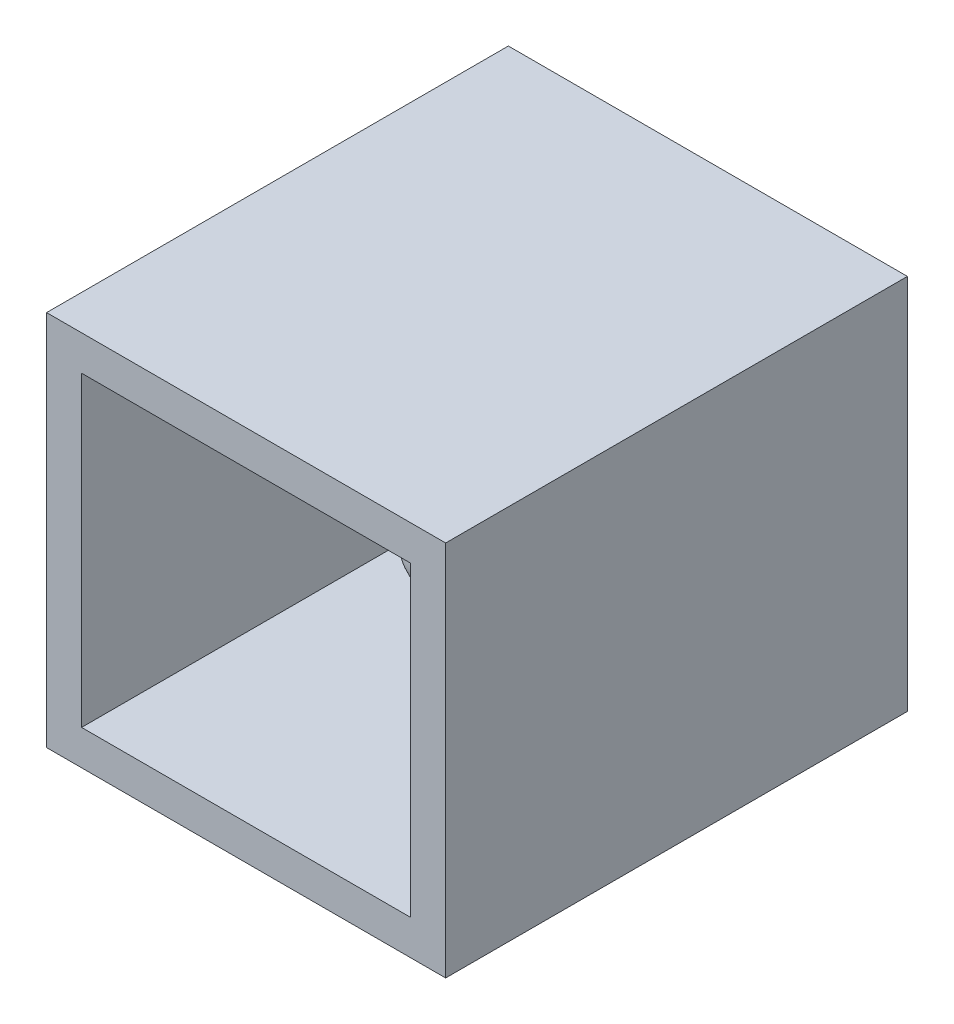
ISO-10303-21;
HEADER;
FILE_DESCRIPTION(('STEP AP214'),'2;1');
FILE_NAME('part.step','',(''),(''),'','','');
FILE_SCHEMA(('AUTOMOTIVE_DESIGN { 1 0 10303 214 1 1 1 1 }'));
ENDSEC;
DATA;
#1=APPLICATION_CONTEXT('core data for automotive mechanical design processes');
#2=APPLICATION_PROTOCOL_DEFINITION('international standard','automotive_design',2000,#1);
#3=PRODUCT_CONTEXT('',#1,'mechanical');
#4=PRODUCT('Part','Part','',(#3));
#5=PRODUCT_RELATED_PRODUCT_CATEGORY('part','',(#4));
#6=PRODUCT_DEFINITION_FORMATION('','',#4);
#7=PRODUCT_DEFINITION_CONTEXT('part definition',#1,'design');
#8=PRODUCT_DEFINITION('design','',#6,#7);
#9=PRODUCT_DEFINITION_SHAPE('','',#8);
#10=(LENGTH_UNIT() NAMED_UNIT(*) SI_UNIT(.MILLI.,.METRE.));
#11=(NAMED_UNIT(*) PLANE_ANGLE_UNIT() SI_UNIT($,.RADIAN.));
#12=(NAMED_UNIT(*) SI_UNIT($,.STERADIAN.) SOLID_ANGLE_UNIT());
#13=UNCERTAINTY_MEASURE_WITH_UNIT(LENGTH_MEASURE(1.E-05),#10,'distance_accuracy_value','');
#14=(GEOMETRIC_REPRESENTATION_CONTEXT(3) GLOBAL_UNCERTAINTY_ASSIGNED_CONTEXT((#13)) GLOBAL_UNIT_ASSIGNED_CONTEXT((#10,
#11,#12)) REPRESENTATION_CONTEXT('',''));
#15=CARTESIAN_POINT('',(0.,0.,0.));
#16=DIRECTION('',(0.,0.,1.));
#17=DIRECTION('',(1.,0.,0.));
#18=AXIS2_PLACEMENT_3D('',#15,#16,#17);
#19=CARTESIAN_POINT('',(0.,38.5181145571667,59.6854477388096));
#20=DIRECTION('',(0.,1.,0.));
#21=DIRECTION('',(0.,0.,-1.));
#22=AXIS2_PLACEMENT_3D('',#19,#20,#21);
#23=SPHERICAL_SURFACE('',#22,12.9621362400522);
#24=CARTESIAN_POINT('',(0.,51.4802507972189,59.6854477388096));
#25=VERTEX_POINT('',#24);
#26=VERTEX_LOOP('',#25);
#27=FACE_BOUND('',#26,.T.);
#28=ADVANCED_FACE('F64',(#27),#23,.T.);
#29=CLOSED_SHELL('',(#28));
#30=MANIFOLD_SOLID_BREP('B2',#29);
#31=CARTESIAN_POINT('',(-56.627294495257,-9.99999999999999,122.));
#32=DIRECTION('',(0.,0.,1.));
#33=DIRECTION('',(1.,0.,0.));
#34=AXIS2_PLACEMENT_3D('',#31,#32,#33);
#35=PLANE('',#34);
#36=DIRECTION('',(0.,-1.,0.));
#37=VECTOR('',#36,1.);
#38=CARTESIAN_POINT('',(-56.627294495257,87.6986315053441,122.));
#39=LINE('',#38,#37);
#40=CARTESIAN_POINT('',(-56.627294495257,97.6986315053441,122.));
#41=VERTEX_POINT('',#40);
#42=CARTESIAN_POINT('',(-56.627294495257,-10.,122.));
#43=VERTEX_POINT('',#42);
#44=EDGE_CURVE('E195',#41,#43,#39,.T.);
#45=ORIENTED_EDGE('',*,*,#44,.T.);
#46=DIRECTION('',(1.,0.,0.));
#47=VECTOR('',#46,1.);
#48=CARTESIAN_POINT('',(-46.627294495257,-9.99999999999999,122.));
#49=LINE('',#48,#47);
#50=CARTESIAN_POINT('',(57.4509829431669,-10.,122.));
#51=VERTEX_POINT('',#50);
#52=EDGE_CURVE('E148',#43,#51,#49,.T.);
#53=ORIENTED_EDGE('',*,*,#52,.T.);
#54=DIRECTION('',(0.,1.,0.));
#55=VECTOR('',#54,1.);
#56=CARTESIAN_POINT('',(57.4509829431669,87.6986315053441,122.));
#57=LINE('',#56,#55);
#58=CARTESIAN_POINT('',(57.4509829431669,97.6986315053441,122.));
#59=VERTEX_POINT('',#58);
#60=EDGE_CURVE('E198',#51,#59,#57,.T.);
#61=ORIENTED_EDGE('',*,*,#60,.T.);
#62=DIRECTION('',(-1.,0.,0.));
#63=VECTOR('',#62,1.);
#64=CARTESIAN_POINT('',(-46.627294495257,97.6986315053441,122.));
#65=LINE('',#64,#63);
#66=EDGE_CURVE('E101',#59,#41,#65,.T.);
#67=ORIENTED_EDGE('',*,*,#66,.T.);
#68=EDGE_LOOP('',(#45,#53,#61,#67));
#69=FACE_BOUND('',#68,.T.);
#70=DIRECTION('',(1.,0.,0.));
#71=VECTOR('',#70,1.);
#72=CARTESIAN_POINT('',(-46.627294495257,0.,122.));
#73=LINE('',#72,#71);
#74=CARTESIAN_POINT('',(-46.627294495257,0.,122.));
#75=VERTEX_POINT('',#74);
#76=CARTESIAN_POINT('',(47.4509829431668,0.,122.));
#77=VERTEX_POINT('',#76);
#78=EDGE_CURVE('E170',#75,#77,#73,.T.);
#79=ORIENTED_EDGE('',*,*,#78,.F.);
#80=DIRECTION('',(0.,-1.,0.));
#81=VECTOR('',#80,1.);
#82=CARTESIAN_POINT('',(-46.627294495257,0.,122.));
#83=LINE('',#82,#81);
#84=CARTESIAN_POINT('',(-46.627294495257,87.6986315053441,122.));
#85=VERTEX_POINT('',#84);
#86=EDGE_CURVE('E168',#85,#75,#83,.T.);
#87=ORIENTED_EDGE('',*,*,#86,.F.);
#88=DIRECTION('',(-1.,0.,0.));
#89=VECTOR('',#88,1.);
#90=CARTESIAN_POINT('',(-46.627294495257,87.6986315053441,122.));
#91=LINE('',#90,#89);
#92=CARTESIAN_POINT('',(47.4509829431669,87.6986315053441,122.));
#93=VERTEX_POINT('',#92);
#94=EDGE_CURVE('E175',#93,#85,#91,.T.);
#95=ORIENTED_EDGE('',*,*,#94,.F.);
#96=DIRECTION('',(0.,1.,0.));
#97=VECTOR('',#96,1.);
#98=CARTESIAN_POINT('',(47.4509829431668,0.,122.));
#99=LINE('',#98,#97);
#100=EDGE_CURVE('E173',#77,#93,#99,.T.);
#101=ORIENTED_EDGE('',*,*,#100,.F.);
#102=EDGE_LOOP('',(#79,#87,#95,#101));
#103=FACE_BOUND('',#102,.T.);
#104=ADVANCED_FACE('F78',(#69,#103),#35,.T.);
#105=CARTESIAN_POINT('',(-56.627294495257,87.6986315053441,122.));
#106=DIRECTION('',(1.,0.,0.));
#107=DIRECTION('',(0.,0.,-1.));
#108=AXIS2_PLACEMENT_3D('',#105,#106,#107);
#109=PLANE('',#108);
#110=DIRECTION('',(0.,0.,-1.));
#111=VECTOR('',#110,1.);
#112=CARTESIAN_POINT('',(-56.627294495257,97.6986315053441,122.));
#113=LINE('',#112,#111);
#114=CARTESIAN_POINT('',(-56.627294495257,97.6986315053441,-10.));
#115=VERTEX_POINT('',#114);
#116=EDGE_CURVE('E153',#41,#115,#113,.T.);
#117=ORIENTED_EDGE('',*,*,#116,.T.);
#118=DIRECTION('',(0.,1.,0.));
#119=VECTOR('',#118,1.);
#120=CARTESIAN_POINT('',(-56.627294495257,-10.,-10.));
#121=LINE('',#120,#119);
#122=CARTESIAN_POINT('',(-56.627294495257,-10.,-10.));
#123=VERTEX_POINT('',#122);
#124=EDGE_CURVE('E152',#123,#115,#121,.T.);
#125=ORIENTED_EDGE('',*,*,#124,.F.);
#126=DIRECTION('',(0.,0.,-1.));
#127=VECTOR('',#126,1.);
#128=CARTESIAN_POINT('',(-56.627294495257,-10.,122.));
#129=LINE('',#128,#127);
#130=EDGE_CURVE('E62',#43,#123,#129,.T.);
#131=ORIENTED_EDGE('',*,*,#130,.F.);
#132=ORIENTED_EDGE('',*,*,#44,.F.);
#133=EDGE_LOOP('',(#117,#125,#131,#132));
#134=FACE_BOUND('',#133,.T.);
#135=ADVANCED_FACE('F80',(#134),#109,.F.);
#136=CARTESIAN_POINT('',(-46.627294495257,-9.99999999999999,122.));
#137=DIRECTION('',(0.,1.,0.));
#138=DIRECTION('',(0.,0.,1.));
#139=AXIS2_PLACEMENT_3D('',#136,#137,#138);
#140=PLANE('',#139);
#141=ORIENTED_EDGE('',*,*,#130,.T.);
#142=DIRECTION('',(-1.,0.,0.));
#143=VECTOR('',#142,1.);
#144=CARTESIAN_POINT('',(57.4509829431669,-10.,-10.));
#145=LINE('',#144,#143);
#146=CARTESIAN_POINT('',(57.4509829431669,-10.,-10.));
#147=VERTEX_POINT('',#146);
#148=EDGE_CURVE('E147',#147,#123,#145,.T.);
#149=ORIENTED_EDGE('',*,*,#148,.F.);
#150=DIRECTION('',(0.,0.,-1.));
#151=VECTOR('',#150,1.);
#152=CARTESIAN_POINT('',(57.4509829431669,-10.,122.));
#153=LINE('',#152,#151);
#154=EDGE_CURVE('E86',#51,#147,#153,.T.);
#155=ORIENTED_EDGE('',*,*,#154,.F.);
#156=ORIENTED_EDGE('',*,*,#52,.F.);
#157=EDGE_LOOP('',(#141,#149,#155,#156));
#158=FACE_BOUND('',#157,.T.);
#159=ADVANCED_FACE('F144',(#158),#140,.F.);
#160=CARTESIAN_POINT('',(57.4509829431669,87.6986315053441,122.));
#161=DIRECTION('',(-1.,0.,0.));
#162=DIRECTION('',(0.,0.,1.));
#163=AXIS2_PLACEMENT_3D('',#160,#161,#162);
#164=PLANE('',#163);
#165=ORIENTED_EDGE('',*,*,#154,.T.);
#166=DIRECTION('',(0.,-1.,0.));
#167=VECTOR('',#166,1.);
#168=CARTESIAN_POINT('',(57.4509829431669,97.6986315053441,-10.));
#169=LINE('',#168,#167);
#170=CARTESIAN_POINT('',(57.4509829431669,97.6986315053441,-10.));
#171=VERTEX_POINT('',#170);
#172=EDGE_CURVE('E162',#171,#147,#169,.T.);
#173=ORIENTED_EDGE('',*,*,#172,.F.);
#174=DIRECTION('',(0.,0.,-1.));
#175=VECTOR('',#174,1.);
#176=CARTESIAN_POINT('',(57.4509829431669,97.6986315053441,122.));
#177=LINE('',#176,#175);
#178=EDGE_CURVE('E202',#59,#171,#177,.T.);
#179=ORIENTED_EDGE('',*,*,#178,.F.);
#180=ORIENTED_EDGE('',*,*,#60,.F.);
#181=EDGE_LOOP('',(#165,#173,#179,#180));
#182=FACE_BOUND('',#181,.T.);
#183=ADVANCED_FACE('F205',(#182),#164,.F.);
#184=CARTESIAN_POINT('',(-46.627294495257,97.6986315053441,122.));
#185=DIRECTION('',(0.,-1.,0.));
#186=DIRECTION('',(0.,0.,-1.));
#187=AXIS2_PLACEMENT_3D('',#184,#185,#186);
#188=PLANE('',#187);
#189=ORIENTED_EDGE('',*,*,#178,.T.);
#190=DIRECTION('',(1.,0.,0.));
#191=VECTOR('',#190,1.);
#192=CARTESIAN_POINT('',(-56.627294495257,97.6986315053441,-10.));
#193=LINE('',#192,#191);
#194=EDGE_CURVE('E157',#115,#171,#193,.T.);
#195=ORIENTED_EDGE('',*,*,#194,.F.);
#196=ORIENTED_EDGE('',*,*,#116,.F.);
#197=ORIENTED_EDGE('',*,*,#66,.F.);
#198=EDGE_LOOP('',(#189,#195,#196,#197));
#199=FACE_BOUND('',#198,.T.);
#200=ADVANCED_FACE('F241',(#199),#188,.F.);
#201=CARTESIAN_POINT('',(-46.627294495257,0.,122.));
#202=DIRECTION('',(1.,0.,0.));
#203=DIRECTION('',(0.,0.,-1.));
#204=AXIS2_PLACEMENT_3D('',#201,#202,#203);
#205=PLANE('',#204);
#206=DIRECTION('',(0.,-1.,0.));
#207=VECTOR('',#206,1.);
#208=CARTESIAN_POINT('',(-46.627294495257,0.,0.));
#209=LINE('',#208,#207);
#210=CARTESIAN_POINT('',(-46.627294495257,87.6986315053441,0.));
#211=VERTEX_POINT('',#210);
#212=CARTESIAN_POINT('',(-46.627294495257,0.,0.));
#213=VERTEX_POINT('',#212);
#214=EDGE_CURVE('E167',#211,#213,#209,.T.);
#215=ORIENTED_EDGE('',*,*,#214,.F.);
#216=DIRECTION('',(0.,0.,-1.));
#217=VECTOR('',#216,1.);
#218=CARTESIAN_POINT('',(-46.627294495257,87.6986315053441,122.));
#219=LINE('',#218,#217);
#220=EDGE_CURVE('E177',#85,#211,#219,.T.);
#221=ORIENTED_EDGE('',*,*,#220,.F.);
#222=ORIENTED_EDGE('',*,*,#86,.T.);
#223=DIRECTION('',(0.,0.,-1.));
#224=VECTOR('',#223,1.);
#225=CARTESIAN_POINT('',(-46.627294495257,0.,122.));
#226=LINE('',#225,#224);
#227=EDGE_CURVE('E192',#75,#213,#226,.T.);
#228=ORIENTED_EDGE('',*,*,#227,.T.);
#229=EDGE_LOOP('',(#215,#221,#222,#228));
#230=FACE_BOUND('',#229,.T.);
#231=ADVANCED_FACE('F225',(#230),#205,.T.);
#232=CARTESIAN_POINT('',(-46.627294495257,0.,122.));
#233=DIRECTION('',(0.,1.,0.));
#234=DIRECTION('',(0.,0.,1.));
#235=AXIS2_PLACEMENT_3D('',#232,#233,#234);
#236=PLANE('',#235);
#237=DIRECTION('',(1.,0.,0.));
#238=VECTOR('',#237,1.);
#239=CARTESIAN_POINT('',(-46.627294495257,0.,0.));
#240=LINE('',#239,#238);
#241=CARTESIAN_POINT('',(47.4509829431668,0.,0.));
#242=VERTEX_POINT('',#241);
#243=EDGE_CURVE('E180',#213,#242,#240,.T.);
#244=ORIENTED_EDGE('',*,*,#243,.F.);
#245=ORIENTED_EDGE('',*,*,#227,.F.);
#246=ORIENTED_EDGE('',*,*,#78,.T.);
#247=DIRECTION('',(0.,0.,-1.));
#248=VECTOR('',#247,1.);
#249=CARTESIAN_POINT('',(47.4509829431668,0.,122.));
#250=LINE('',#249,#248);
#251=EDGE_CURVE('E190',#77,#242,#250,.T.);
#252=ORIENTED_EDGE('',*,*,#251,.T.);
#253=EDGE_LOOP('',(#244,#245,#246,#252));
#254=FACE_BOUND('',#253,.T.);
#255=ADVANCED_FACE('F217',(#254),#236,.T.);
#256=CARTESIAN_POINT('',(47.4509829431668,0.,122.));
#257=DIRECTION('',(-1.,0.,0.));
#258=DIRECTION('',(0.,0.,1.));
#259=AXIS2_PLACEMENT_3D('',#256,#257,#258);
#260=PLANE('',#259);
#261=DIRECTION('',(0.,1.,0.));
#262=VECTOR('',#261,1.);
#263=CARTESIAN_POINT('',(47.4509829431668,0.,0.));
#264=LINE('',#263,#262);
#265=CARTESIAN_POINT('',(47.4509829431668,87.6986315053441,0.));
#266=VERTEX_POINT('',#265);
#267=EDGE_CURVE('E183',#242,#266,#264,.T.);
#268=ORIENTED_EDGE('',*,*,#267,.F.);
#269=ORIENTED_EDGE('',*,*,#251,.F.);
#270=ORIENTED_EDGE('',*,*,#100,.T.);
#271=DIRECTION('',(0.,0.,-1.));
#272=VECTOR('',#271,1.);
#273=CARTESIAN_POINT('',(47.4509829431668,87.6986315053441,122.));
#274=LINE('',#273,#272);
#275=EDGE_CURVE('E93',#93,#266,#274,.T.);
#276=ORIENTED_EDGE('',*,*,#275,.T.);
#277=EDGE_LOOP('',(#268,#269,#270,#276));
#278=FACE_BOUND('',#277,.T.);
#279=ADVANCED_FACE('F220',(#278),#260,.T.);
#280=CARTESIAN_POINT('',(-46.627294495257,87.6986315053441,122.));
#281=DIRECTION('',(0.,-1.,0.));
#282=DIRECTION('',(0.,0.,-1.));
#283=AXIS2_PLACEMENT_3D('',#280,#281,#282);
#284=PLANE('',#283);
#285=DIRECTION('',(-1.,0.,0.));
#286=VECTOR('',#285,1.);
#287=CARTESIAN_POINT('',(-46.627294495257,87.6986315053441,0.));
#288=LINE('',#287,#286);
#289=EDGE_CURVE('E171',#266,#211,#288,.T.);
#290=ORIENTED_EDGE('',*,*,#289,.F.);
#291=ORIENTED_EDGE('',*,*,#275,.F.);
#292=ORIENTED_EDGE('',*,*,#94,.T.);
#293=ORIENTED_EDGE('',*,*,#220,.T.);
#294=EDGE_LOOP('',(#290,#291,#292,#293));
#295=FACE_BOUND('',#294,.T.);
#296=ADVANCED_FACE('F227',(#295),#284,.T.);
#297=CARTESIAN_POINT('',(-56.627294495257,-10.,0.));
#298=DIRECTION('',(0.,0.,-1.));
#299=DIRECTION('',(-1.,0.,0.));
#300=AXIS2_PLACEMENT_3D('',#297,#298,#299);
#301=PLANE('',#300);
#302=ORIENTED_EDGE('',*,*,#214,.T.);
#303=ORIENTED_EDGE('',*,*,#243,.T.);
#304=ORIENTED_EDGE('',*,*,#267,.T.);
#305=ORIENTED_EDGE('',*,*,#289,.T.);
#306=EDGE_LOOP('',(#302,#303,#304,#305));
#307=FACE_BOUND('',#306,.T.);
#308=ADVANCED_FACE('F222',(#307),#301,.F.);
#309=CARTESIAN_POINT('',(-56.627294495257,-10.,-10.));
#310=DIRECTION('',(0.,0.,-1.));
#311=DIRECTION('',(-1.,0.,0.));
#312=AXIS2_PLACEMENT_3D('',#309,#310,#311);
#313=PLANE('',#312);
#314=ORIENTED_EDGE('',*,*,#148,.T.);
#315=ORIENTED_EDGE('',*,*,#124,.T.);
#316=ORIENTED_EDGE('',*,*,#194,.T.);
#317=ORIENTED_EDGE('',*,*,#172,.T.);
#318=EDGE_LOOP('',(#314,#315,#316,#317));
#319=FACE_BOUND('',#318,.T.);
#320=ADVANCED_FACE('F160',(#319),#313,.T.);
#321=CLOSED_SHELL('',(#104,#135,#159,#183,#200,#231,#255,#279,#296,#308,#320));
#322=MANIFOLD_SOLID_BREP('B7',#321);
#323=ADVANCED_BREP_SHAPE_REPRESENTATION('',(#18,#30,#322),#14);
#324=SHAPE_DEFINITION_REPRESENTATION(#9,#323);
ENDSEC;
END-ISO-10303-21;
